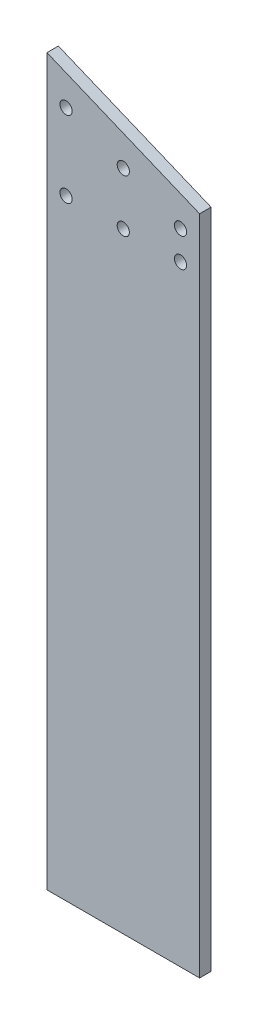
from build123d import *

# Parameters (mm, degrees)
ESQUISSE1_W             = 200
ESQUISSE1_H             = 950
BOSS_EXTRU_1_DEPTH      = 15
ENL_V_MAT_EXTRU_1_DEPTH = 15
ESQUISSE3_R             = 8
ENL_V_MAT_EXTRU_2_DEPTH = 486.643902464


with BuildPart() as part:
    # Esquisse1 → Boss.-Extru.1 (new body)
    with BuildSketch(Plane.XY):
        Rectangle(ESQUISSE1_W, ESQUISSE1_H)
    extrude(amount=BOSS_EXTRU_1_DEPTH)

    # Esquisse2 → Enl_v. mat.-Extru.1 (cut)
    with BuildSketch(Plane.XY.offset(15)):
        Polygon((-100, 475), (100, 392.157287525), (100, 475), align=None)
    extrude(amount=-ENL_V_MAT_EXTRU_1_DEPTH, mode=Mode.SUBTRACT)

    # Esquisse3 → Enl_v. mat.-Extru.2 (cut, through all)
    with BuildSketch(Plane.XY.offset(15)):
        with Locations((-75, 325)):
            Circle(ESQUISSE3_R)
        with Locations((0, 325)):
            Circle(ESQUISSE3_R)
        with Locations((75, 325)):
            Circle(ESQUISSE3_R)
        with Locations((-75, 425)):
            Circle(ESQUISSE3_R)
        with Locations((0, 393.933982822)):
            Circle(ESQUISSE3_R)
        with Locations((75, 362.867948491)):
            Circle(ESQUISSE3_R)
    extrude(amount=-ENL_V_MAT_EXTRU_2_DEPTH, mode=Mode.SUBTRACT)


solid = part.part
